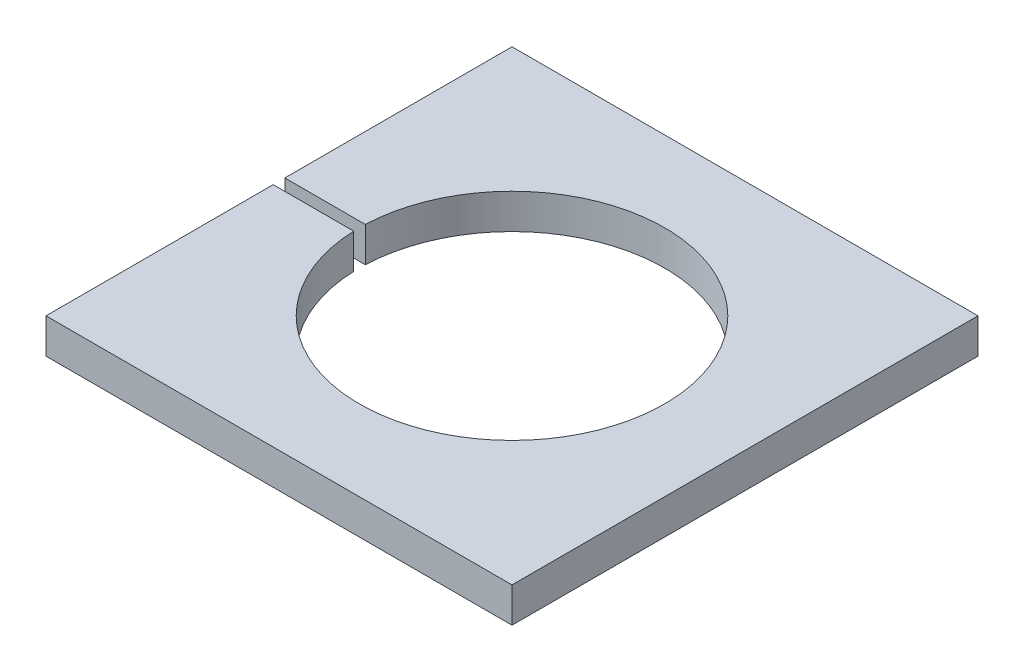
ISO-10303-21;
HEADER;
FILE_DESCRIPTION(('STEP AP214'),'2;1');
FILE_NAME('part.step','',(''),(''),'','','');
FILE_SCHEMA(('AUTOMOTIVE_DESIGN { 1 0 10303 214 1 1 1 1 }'));
ENDSEC;
DATA;
#1=APPLICATION_CONTEXT('core data for automotive mechanical design processes');
#2=APPLICATION_PROTOCOL_DEFINITION('international standard','automotive_design',2000,#1);
#3=PRODUCT_CONTEXT('',#1,'mechanical');
#4=PRODUCT('Part','Part','',(#3));
#5=PRODUCT_RELATED_PRODUCT_CATEGORY('part','',(#4));
#6=PRODUCT_DEFINITION_FORMATION('','',#4);
#7=PRODUCT_DEFINITION_CONTEXT('part definition',#1,'design');
#8=PRODUCT_DEFINITION('design','',#6,#7);
#9=PRODUCT_DEFINITION_SHAPE('','',#8);
#10=(LENGTH_UNIT() NAMED_UNIT(*) SI_UNIT(.MILLI.,.METRE.));
#11=(NAMED_UNIT(*) PLANE_ANGLE_UNIT() SI_UNIT($,.RADIAN.));
#12=(NAMED_UNIT(*) SI_UNIT($,.STERADIAN.) SOLID_ANGLE_UNIT());
#13=UNCERTAINTY_MEASURE_WITH_UNIT(LENGTH_MEASURE(1.E-05),#10,'distance_accuracy_value','');
#14=(GEOMETRIC_REPRESENTATION_CONTEXT(3) GLOBAL_UNCERTAINTY_ASSIGNED_CONTEXT((#13)) GLOBAL_UNIT_ASSIGNED_CONTEXT((#10,
#11,#12)) REPRESENTATION_CONTEXT('',''));
#15=CARTESIAN_POINT('',(0.,0.,0.));
#16=DIRECTION('',(0.,0.,1.));
#17=DIRECTION('',(1.,0.,0.));
#18=AXIS2_PLACEMENT_3D('',#15,#16,#17);
#19=CARTESIAN_POINT('',(-40.,6.,-40.));
#20=DIRECTION('',(1.,0.,0.));
#21=DIRECTION('',(0.,0.,-1.));
#22=AXIS2_PLACEMENT_3D('',#19,#20,#21);
#23=PLANE('',#22);
#24=DIRECTION('',(0.,1.,0.));
#25=VECTOR('',#24,1.);
#26=CARTESIAN_POINT('',(-40.,0.,1.));
#27=LINE('',#26,#25);
#28=CARTESIAN_POINT('',(-40.,0.,1.));
#29=VERTEX_POINT('',#28);
#30=CARTESIAN_POINT('',(-40.,6.,1.));
#31=VERTEX_POINT('',#30);
#32=EDGE_CURVE('E109',#29,#31,#27,.T.);
#33=ORIENTED_EDGE('',*,*,#32,.F.);
#34=DIRECTION('',(0.,0.,1.));
#35=VECTOR('',#34,1.);
#36=CARTESIAN_POINT('',(-40.,0.,-40.));
#37=LINE('',#36,#35);
#38=CARTESIAN_POINT('',(-40.,0.,40.));
#39=VERTEX_POINT('',#38);
#40=EDGE_CURVE('E145',#29,#39,#37,.T.);
#41=ORIENTED_EDGE('',*,*,#40,.T.);
#42=DIRECTION('',(0.,-1.,0.));
#43=VECTOR('',#42,1.);
#44=CARTESIAN_POINT('',(-40.,6.,40.));
#45=LINE('',#44,#43);
#46=CARTESIAN_POINT('',(-40.,6.,40.));
#47=VERTEX_POINT('',#46);
#48=EDGE_CURVE('E135',#47,#39,#45,.T.);
#49=ORIENTED_EDGE('',*,*,#48,.F.);
#50=DIRECTION('',(0.,0.,1.));
#51=VECTOR('',#50,1.);
#52=CARTESIAN_POINT('',(-40.,6.,-40.));
#53=LINE('',#52,#51);
#54=EDGE_CURVE('E117',#31,#47,#53,.T.);
#55=ORIENTED_EDGE('',*,*,#54,.F.);
#56=EDGE_LOOP('',(#33,#41,#49,#55));
#57=FACE_BOUND('',#56,.T.);
#58=ADVANCED_FACE('F31',(#57),#23,.F.);
#59=CARTESIAN_POINT('',(-40.,6.,40.));
#60=DIRECTION('',(0.,1.,0.));
#61=DIRECTION('',(0.,0.,1.));
#62=AXIS2_PLACEMENT_3D('',#59,#60,#61);
#63=PLANE('',#62);
#64=DIRECTION('',(-1.,0.,0.));
#65=VECTOR('',#64,1.);
#66=CARTESIAN_POINT('',(0.,6.,-1.));
#67=LINE('',#66,#65);
#68=CARTESIAN_POINT('',(-26.1809090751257,6.,-1.));
#69=VERTEX_POINT('',#68);
#70=CARTESIAN_POINT('',(-40.,6.,-1.));
#71=VERTEX_POINT('',#70);
#72=EDGE_CURVE('E93',#69,#71,#67,.T.);
#73=ORIENTED_EDGE('',*,*,#72,.F.);
#74=CARTESIAN_POINT('',(0.,6.,0.));
#75=DIRECTION('',(0.,1.,0.));
#76=DIRECTION('',(0.,0.,1.));
#77=AXIS2_PLACEMENT_3D('',#74,#75,#76);
#78=CIRCLE('',#77,26.2);
#79=CARTESIAN_POINT('',(-26.1809090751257,6.,1.));
#80=VERTEX_POINT('',#79);
#81=EDGE_CURVE('E140',#80,#69,#78,.T.);
#82=ORIENTED_EDGE('',*,*,#81,.F.);
#83=DIRECTION('',(-1.,0.,0.));
#84=VECTOR('',#83,1.);
#85=CARTESIAN_POINT('',(0.,6.,1.));
#86=LINE('',#85,#84);
#87=EDGE_CURVE('E53',#80,#31,#86,.T.);
#88=ORIENTED_EDGE('',*,*,#87,.T.);
#89=ORIENTED_EDGE('',*,*,#54,.T.);
#90=DIRECTION('',(1.,0.,0.));
#91=VECTOR('',#90,1.);
#92=CARTESIAN_POINT('',(-40.,6.,40.));
#93=LINE('',#92,#91);
#94=CARTESIAN_POINT('',(40.,6.,40.));
#95=VERTEX_POINT('',#94);
#96=EDGE_CURVE('E116',#47,#95,#93,.T.);
#97=ORIENTED_EDGE('',*,*,#96,.T.);
#98=DIRECTION('',(0.,0.,-1.));
#99=VECTOR('',#98,1.);
#100=CARTESIAN_POINT('',(40.,6.,-40.));
#101=LINE('',#100,#99);
#102=CARTESIAN_POINT('',(40.,6.,-40.));
#103=VERTEX_POINT('',#102);
#104=EDGE_CURVE('E119',#95,#103,#101,.T.);
#105=ORIENTED_EDGE('',*,*,#104,.T.);
#106=DIRECTION('',(-1.,0.,0.));
#107=VECTOR('',#106,1.);
#108=CARTESIAN_POINT('',(-40.,6.,-40.));
#109=LINE('',#108,#107);
#110=CARTESIAN_POINT('',(-40.,6.,-40.));
#111=VERTEX_POINT('',#110);
#112=EDGE_CURVE('E114',#103,#111,#109,.T.);
#113=ORIENTED_EDGE('',*,*,#112,.T.);
#114=EDGE_CURVE('E106',#111,#71,#53,.T.);
#115=ORIENTED_EDGE('',*,*,#114,.T.);
#116=EDGE_LOOP('',(#73,#82,#88,#89,#97,#105,#113,#115));
#117=FACE_BOUND('',#116,.T.);
#118=ADVANCED_FACE('F112',(#117),#63,.T.);
#119=CARTESIAN_POINT('',(-40.,0.,40.));
#120=DIRECTION('',(0.,1.,0.));
#121=DIRECTION('',(0.,0.,1.));
#122=AXIS2_PLACEMENT_3D('',#119,#120,#121);
#123=PLANE('',#122);
#124=CARTESIAN_POINT('',(0.,0.,0.));
#125=DIRECTION('',(0.,1.,0.));
#126=DIRECTION('',(0.,0.,1.));
#127=AXIS2_PLACEMENT_3D('',#124,#125,#126);
#128=CIRCLE('',#127,26.2);
#129=CARTESIAN_POINT('',(-26.1809090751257,0.,1.));
#130=VERTEX_POINT('',#129);
#131=CARTESIAN_POINT('',(-26.1809090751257,0.,-1.));
#132=VERTEX_POINT('',#131);
#133=EDGE_CURVE('E142',#130,#132,#128,.T.);
#134=ORIENTED_EDGE('',*,*,#133,.T.);
#135=DIRECTION('',(-1.,0.,0.));
#136=VECTOR('',#135,1.);
#137=CARTESIAN_POINT('',(0.,0.,-1.));
#138=LINE('',#137,#136);
#139=CARTESIAN_POINT('',(-40.,0.,-1.));
#140=VERTEX_POINT('',#139);
#141=EDGE_CURVE('E45',#132,#140,#138,.T.);
#142=ORIENTED_EDGE('',*,*,#141,.T.);
#143=CARTESIAN_POINT('',(-40.,0.,-40.));
#144=VERTEX_POINT('',#143);
#145=EDGE_CURVE('E108',#144,#140,#37,.T.);
#146=ORIENTED_EDGE('',*,*,#145,.F.);
#147=DIRECTION('',(-1.,0.,0.));
#148=VECTOR('',#147,1.);
#149=CARTESIAN_POINT('',(-40.,0.,-40.));
#150=LINE('',#149,#148);
#151=CARTESIAN_POINT('',(40.,0.,-40.));
#152=VERTEX_POINT('',#151);
#153=EDGE_CURVE('E121',#152,#144,#150,.T.);
#154=ORIENTED_EDGE('',*,*,#153,.F.);
#155=DIRECTION('',(0.,0.,-1.));
#156=VECTOR('',#155,1.);
#157=CARTESIAN_POINT('',(40.,0.,-40.));
#158=LINE('',#157,#156);
#159=CARTESIAN_POINT('',(40.,0.,40.));
#160=VERTEX_POINT('',#159);
#161=EDGE_CURVE('E151',#160,#152,#158,.T.);
#162=ORIENTED_EDGE('',*,*,#161,.F.);
#163=DIRECTION('',(1.,0.,0.));
#164=VECTOR('',#163,1.);
#165=CARTESIAN_POINT('',(-40.,0.,40.));
#166=LINE('',#165,#164);
#167=EDGE_CURVE('E150',#39,#160,#166,.T.);
#168=ORIENTED_EDGE('',*,*,#167,.F.);
#169=ORIENTED_EDGE('',*,*,#40,.F.);
#170=DIRECTION('',(-1.,0.,0.));
#171=VECTOR('',#170,1.);
#172=CARTESIAN_POINT('',(0.,0.,1.));
#173=LINE('',#172,#171);
#174=EDGE_CURVE('E110',#130,#29,#173,.T.);
#175=ORIENTED_EDGE('',*,*,#174,.F.);
#176=EDGE_LOOP('',(#134,#142,#146,#154,#162,#168,#169,#175));
#177=FACE_BOUND('',#176,.T.);
#178=ADVANCED_FACE('F159',(#177),#123,.F.);
#179=ORIENTED_EDGE('',*,*,#145,.T.);
#180=DIRECTION('',(0.,1.,0.));
#181=VECTOR('',#180,1.);
#182=CARTESIAN_POINT('',(-40.,0.,-1.));
#183=LINE('',#182,#181);
#184=EDGE_CURVE('E96',#140,#71,#183,.T.);
#185=ORIENTED_EDGE('',*,*,#184,.T.);
#186=ORIENTED_EDGE('',*,*,#114,.F.);
#187=DIRECTION('',(0.,-1.,0.));
#188=VECTOR('',#187,1.);
#189=CARTESIAN_POINT('',(-40.,6.,-40.));
#190=LINE('',#189,#188);
#191=EDGE_CURVE('E127',#111,#144,#190,.T.);
#192=ORIENTED_EDGE('',*,*,#191,.T.);
#193=EDGE_LOOP('',(#179,#185,#186,#192));
#194=FACE_BOUND('',#193,.T.);
#195=ADVANCED_FACE('F33',(#194),#23,.F.);
#196=CARTESIAN_POINT('',(-40.,6.,40.));
#197=DIRECTION('',(0.,0.,-1.));
#198=DIRECTION('',(-1.,0.,0.));
#199=AXIS2_PLACEMENT_3D('',#196,#197,#198);
#200=PLANE('',#199);
#201=ORIENTED_EDGE('',*,*,#167,.T.);
#202=DIRECTION('',(0.,-1.,0.));
#203=VECTOR('',#202,1.);
#204=CARTESIAN_POINT('',(40.,6.,40.));
#205=LINE('',#204,#203);
#206=EDGE_CURVE('E132',#95,#160,#205,.T.);
#207=ORIENTED_EDGE('',*,*,#206,.F.);
#208=ORIENTED_EDGE('',*,*,#96,.F.);
#209=ORIENTED_EDGE('',*,*,#48,.T.);
#210=EDGE_LOOP('',(#201,#207,#208,#209));
#211=FACE_BOUND('',#210,.T.);
#212=ADVANCED_FACE('F173',(#211),#200,.F.);
#213=CARTESIAN_POINT('',(40.,6.,-40.));
#214=DIRECTION('',(-1.,0.,0.));
#215=DIRECTION('',(0.,0.,1.));
#216=AXIS2_PLACEMENT_3D('',#213,#214,#215);
#217=PLANE('',#216);
#218=ORIENTED_EDGE('',*,*,#161,.T.);
#219=DIRECTION('',(0.,-1.,0.));
#220=VECTOR('',#219,1.);
#221=CARTESIAN_POINT('',(40.,6.,-40.));
#222=LINE('',#221,#220);
#223=EDGE_CURVE('E129',#103,#152,#222,.T.);
#224=ORIENTED_EDGE('',*,*,#223,.F.);
#225=ORIENTED_EDGE('',*,*,#104,.F.);
#226=ORIENTED_EDGE('',*,*,#206,.T.);
#227=EDGE_LOOP('',(#218,#224,#225,#226));
#228=FACE_BOUND('',#227,.T.);
#229=ADVANCED_FACE('F175',(#228),#217,.F.);
#230=CARTESIAN_POINT('',(-40.,6.,-40.));
#231=DIRECTION('',(0.,0.,1.));
#232=DIRECTION('',(1.,0.,0.));
#233=AXIS2_PLACEMENT_3D('',#230,#231,#232);
#234=PLANE('',#233);
#235=ORIENTED_EDGE('',*,*,#153,.T.);
#236=ORIENTED_EDGE('',*,*,#191,.F.);
#237=ORIENTED_EDGE('',*,*,#112,.F.);
#238=ORIENTED_EDGE('',*,*,#223,.T.);
#239=EDGE_LOOP('',(#235,#236,#237,#238));
#240=FACE_BOUND('',#239,.T.);
#241=ADVANCED_FACE('F157',(#240),#234,.F.);
#242=CARTESIAN_POINT('',(0.,6.,0.));
#243=DIRECTION('',(0.,-1.,0.));
#244=DIRECTION('',(0.,0.,-1.));
#245=AXIS2_PLACEMENT_3D('',#242,#243,#244);
#246=CYLINDRICAL_SURFACE('',#245,26.2);
#247=DIRECTION('',(0.,-1.,0.));
#248=VECTOR('',#247,1.);
#249=CARTESIAN_POINT('',(-26.1809090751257,6.,-1.));
#250=LINE('',#249,#248);
#251=EDGE_CURVE('E11',#132,#69,#250,.F.);
#252=ORIENTED_EDGE('',*,*,#251,.F.);
#253=ORIENTED_EDGE('',*,*,#133,.F.);
#254=DIRECTION('',(0.,-1.,0.));
#255=VECTOR('',#254,1.);
#256=CARTESIAN_POINT('',(-26.1809090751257,6.,1.));
#257=LINE('',#256,#255);
#258=EDGE_CURVE('E39',#130,#80,#257,.F.);
#259=ORIENTED_EDGE('',*,*,#258,.T.);
#260=ORIENTED_EDGE('',*,*,#81,.T.);
#261=EDGE_LOOP('',(#252,#253,#259,#260));
#262=FACE_BOUND('',#261,.T.);
#263=ADVANCED_FACE('F139',(#262),#246,.F.);
#264=CARTESIAN_POINT('',(0.,0.,1.));
#265=DIRECTION('',(0.,0.,-1.));
#266=DIRECTION('',(-1.,0.,0.));
#267=AXIS2_PLACEMENT_3D('',#264,#265,#266);
#268=PLANE('',#267);
#269=ORIENTED_EDGE('',*,*,#174,.T.);
#270=ORIENTED_EDGE('',*,*,#32,.T.);
#271=ORIENTED_EDGE('',*,*,#87,.F.);
#272=ORIENTED_EDGE('',*,*,#258,.F.);
#273=EDGE_LOOP('',(#269,#270,#271,#272));
#274=FACE_BOUND('',#273,.T.);
#275=ADVANCED_FACE('F165',(#274),#268,.T.);
#276=CARTESIAN_POINT('',(0.,0.,-1.));
#277=DIRECTION('',(0.,0.,-1.));
#278=DIRECTION('',(-1.,0.,0.));
#279=AXIS2_PLACEMENT_3D('',#276,#277,#278);
#280=PLANE('',#279);
#281=ORIENTED_EDGE('',*,*,#251,.T.);
#282=ORIENTED_EDGE('',*,*,#72,.T.);
#283=ORIENTED_EDGE('',*,*,#184,.F.);
#284=ORIENTED_EDGE('',*,*,#141,.F.);
#285=EDGE_LOOP('',(#281,#282,#283,#284));
#286=FACE_BOUND('',#285,.T.);
#287=ADVANCED_FACE('F95',(#286),#280,.F.);
#288=CLOSED_SHELL('',(#58,#118,#178,#195,#212,#229,#241,#263,#275,#287));
#289=MANIFOLD_SOLID_BREP('B2',#288);
#290=ADVANCED_BREP_SHAPE_REPRESENTATION('',(#18,#289),#14);
#291=SHAPE_DEFINITION_REPRESENTATION(#9,#290);
ENDSEC;
END-ISO-10303-21;
